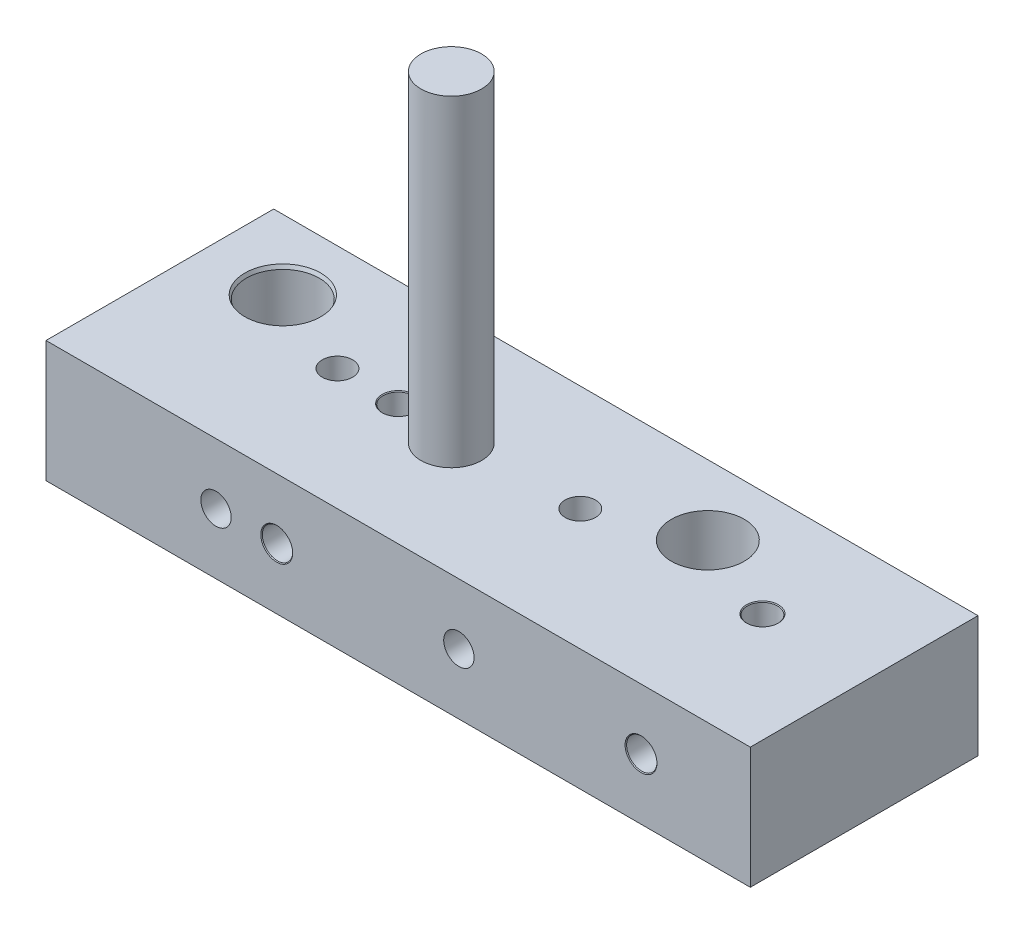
ISO-10303-21;
HEADER;
FILE_DESCRIPTION(('STEP AP214'),'2;1');
FILE_NAME('part.step','',(''),(''),'','','');
FILE_SCHEMA(('AUTOMOTIVE_DESIGN { 1 0 10303 214 1 1 1 1 }'));
ENDSEC;
DATA;
#1=APPLICATION_CONTEXT('core data for automotive mechanical design processes');
#2=APPLICATION_PROTOCOL_DEFINITION('international standard','automotive_design',2000,#1);
#3=PRODUCT_CONTEXT('',#1,'mechanical');
#4=PRODUCT('Part','Part','',(#3));
#5=PRODUCT_RELATED_PRODUCT_CATEGORY('part','',(#4));
#6=PRODUCT_DEFINITION_FORMATION('','',#4);
#7=PRODUCT_DEFINITION_CONTEXT('part definition',#1,'design');
#8=PRODUCT_DEFINITION('design','',#6,#7);
#9=PRODUCT_DEFINITION_SHAPE('','',#8);
#10=(LENGTH_UNIT() NAMED_UNIT(*) SI_UNIT(.MILLI.,.METRE.));
#11=(NAMED_UNIT(*) PLANE_ANGLE_UNIT() SI_UNIT($,.RADIAN.));
#12=(NAMED_UNIT(*) SI_UNIT($,.STERADIAN.) SOLID_ANGLE_UNIT());
#13=UNCERTAINTY_MEASURE_WITH_UNIT(LENGTH_MEASURE(1.E-05),#10,'distance_accuracy_value','');
#14=(GEOMETRIC_REPRESENTATION_CONTEXT(3) GLOBAL_UNCERTAINTY_ASSIGNED_CONTEXT((#13)) GLOBAL_UNIT_ASSIGNED_CONTEXT((#10,
#11,#12)) REPRESENTATION_CONTEXT('',''));
#15=CARTESIAN_POINT('',(0.,0.,0.));
#16=DIRECTION('',(0.,0.,1.));
#17=DIRECTION('',(1.,0.,0.));
#18=AXIS2_PLACEMENT_3D('',#15,#16,#17);
#19=CARTESIAN_POINT('',(0.,20.,-37.5));
#20=DIRECTION('',(0.,-1.,0.));
#21=DIRECTION('',(0.,0.,-1.));
#22=AXIS2_PLACEMENT_3D('',#19,#20,#21);
#23=PLANE('',#22);
#24=CARTESIAN_POINT('',(83.,20.,-26.));
#25=DIRECTION('',(0.,-1.,0.));
#26=DIRECTION('',(0.,0.,-1.));
#27=AXIS2_PLACEMENT_3D('',#24,#25,#26);
#28=CIRCLE('',#27,6.);
#29=CARTESIAN_POINT('',(83.,20.,-32.));
#30=VERTEX_POINT('',#29);
#31=EDGE_CURVE('E9178',#30,#30,#28,.T.);
#32=ORIENTED_EDGE('',*,*,#31,.T.);
#33=EDGE_LOOP('',(#32));
#34=FACE_BOUND('',#33,.T.);
#35=DIRECTION('',(0.,0.,1.));
#36=VECTOR('',#35,1.);
#37=CARTESIAN_POINT('',(0.,20.,0.));
#38=LINE('',#37,#36);
#39=CARTESIAN_POINT('',(0.,20.,-37.5));
#40=VERTEX_POINT('',#39);
#41=CARTESIAN_POINT('',(0.,20.,0.));
#42=VERTEX_POINT('',#41);
#43=EDGE_CURVE('E9306',#40,#42,#38,.T.);
#44=ORIENTED_EDGE('',*,*,#43,.T.);
#45=DIRECTION('',(1.,0.,0.));
#46=VECTOR('',#45,1.);
#47=CARTESIAN_POINT('',(0.,20.,0.));
#48=LINE('',#47,#46);
#49=CARTESIAN_POINT('',(116.,20.,0.));
#50=VERTEX_POINT('',#49);
#51=EDGE_CURVE('E9304',#42,#50,#48,.T.);
#52=ORIENTED_EDGE('',*,*,#51,.T.);
#53=DIRECTION('',(0.,0.,-1.));
#54=VECTOR('',#53,1.);
#55=CARTESIAN_POINT('',(116.,20.,0.));
#56=LINE('',#55,#54);
#57=CARTESIAN_POINT('',(116.,20.,-37.5));
#58=VERTEX_POINT('',#57);
#59=EDGE_CURVE('E9302',#50,#58,#56,.T.);
#60=ORIENTED_EDGE('',*,*,#59,.T.);
#61=DIRECTION('',(-1.,0.,0.));
#62=VECTOR('',#61,1.);
#63=CARTESIAN_POINT('',(0.,20.,-37.5));
#64=LINE('',#63,#62);
#65=EDGE_CURVE('E9300',#58,#40,#64,.T.);
#66=ORIENTED_EDGE('',*,*,#65,.T.);
#67=EDGE_LOOP('',(#44,#52,#60,#66));
#68=FACE_BOUND('',#67,.T.);
#69=CARTESIAN_POINT('',(13.,20.,-26.));
#70=DIRECTION('',(0.,-1.,0.));
#71=DIRECTION('',(0.,0.,-1.));
#72=AXIS2_PLACEMENT_3D('',#69,#70,#71);
#73=CIRCLE('',#72,6.25);
#74=CARTESIAN_POINT('',(13.,20.,-32.25));
#75=VERTEX_POINT('',#74);
#76=EDGE_CURVE('E9327',#75,#75,#73,.T.);
#77=ORIENTED_EDGE('',*,*,#76,.T.);
#78=EDGE_LOOP('',(#77));
#79=FACE_BOUND('',#78,.T.);
#80=CARTESIAN_POINT('',(28.,20.,-20.));
#81=DIRECTION('',(0.,-1.,0.));
#82=DIRECTION('',(0.,0.,-1.));
#83=AXIS2_PLACEMENT_3D('',#80,#81,#82);
#84=CIRCLE('',#83,2.5);
#85=CARTESIAN_POINT('',(28.,20.,-22.5));
#86=VERTEX_POINT('',#85);
#87=EDGE_CURVE('E9333',#86,#86,#84,.T.);
#88=ORIENTED_EDGE('',*,*,#87,.T.);
#89=EDGE_LOOP('',(#88));
#90=FACE_BOUND('',#89,.T.);
#91=CARTESIAN_POINT('',(68.,20.,-20.));
#92=DIRECTION('',(0.,-1.,0.));
#93=DIRECTION('',(0.,0.,-1.));
#94=AXIS2_PLACEMENT_3D('',#91,#92,#93);
#95=CIRCLE('',#94,2.5);
#96=CARTESIAN_POINT('',(68.,20.,-22.5));
#97=VERTEX_POINT('',#96);
#98=EDGE_CURVE('E9339',#97,#97,#95,.T.);
#99=ORIENTED_EDGE('',*,*,#98,.T.);
#100=EDGE_LOOP('',(#99));
#101=FACE_BOUND('',#100,.T.);
#102=CARTESIAN_POINT('',(38.,20.,-20.));
#103=DIRECTION('',(0.,-1.,0.));
#104=DIRECTION('',(0.,0.,-1.));
#105=AXIS2_PLACEMENT_3D('',#102,#103,#104);
#106=CIRCLE('',#105,2.625);
#107=CARTESIAN_POINT('',(38.,20.,-22.625));
#108=VERTEX_POINT('',#107);
#109=EDGE_CURVE('E9351',#108,#108,#106,.T.);
#110=ORIENTED_EDGE('',*,*,#109,.T.);
#111=EDGE_LOOP('',(#110));
#112=FACE_BOUND('',#111,.T.);
#113=CARTESIAN_POINT('',(98.,20.,-20.));
#114=DIRECTION('',(0.,-1.,0.));
#115=DIRECTION('',(0.,0.,-1.));
#116=AXIS2_PLACEMENT_3D('',#113,#114,#115);
#117=CIRCLE('',#116,2.62499999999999);
#118=CARTESIAN_POINT('',(98.,20.,-22.625));
#119=VERTEX_POINT('',#118);
#120=EDGE_CURVE('E9363',#119,#119,#117,.T.);
#121=ORIENTED_EDGE('',*,*,#120,.T.);
#122=EDGE_LOOP('',(#121));
#123=FACE_BOUND('',#122,.T.);
#124=CARTESIAN_POINT('',(48.,20.,-18.75));
#125=DIRECTION('',(0.,-1.,0.));
#126=DIRECTION('',(0.,0.,-1.));
#127=AXIS2_PLACEMENT_3D('',#124,#125,#126);
#128=CIRCLE('',#127,5.);
#129=CARTESIAN_POINT('',(48.,20.,-23.75));
#130=VERTEX_POINT('',#129);
#131=EDGE_CURVE('E11',#130,#130,#128,.F.);
#132=ORIENTED_EDGE('',*,*,#131,.F.);
#133=EDGE_LOOP('',(#132));
#134=FACE_BOUND('',#133,.T.);
#135=ADVANCED_FACE('F9174',(#34,#68,#79,#90,#101,#112,#123,#134),#23,.F.);
#136=CARTESIAN_POINT('',(68.,0.,-20.));
#137=DIRECTION('',(0.,-1.,0.));
#138=DIRECTION('',(0.,0.,-1.));
#139=AXIS2_PLACEMENT_3D('',#136,#137,#138);
#140=CYLINDRICAL_SURFACE('',#139,2.5);
#141=CARTESIAN_POINT('',(68.,0.,-20.));
#142=DIRECTION('',(0.,-1.,0.));
#143=DIRECTION('',(0.,0.,-1.));
#144=AXIS2_PLACEMENT_3D('',#141,#142,#143);
#145=CIRCLE('',#144,2.49999999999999);
#146=CARTESIAN_POINT('',(68.,0.,-22.5));
#147=VERTEX_POINT('',#146);
#148=EDGE_CURVE('E9336',#147,#147,#145,.T.);
#149=ORIENTED_EDGE('',*,*,#148,.T.);
#150=EDGE_LOOP('',(#149));
#151=FACE_BOUND('',#150,.T.);
#152=CARTESIAN_POINT('',(68.,10.,-20.));
#153=DIRECTION('',(0.,-0.707106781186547,-0.707106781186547));
#154=DIRECTION('',(0.,-0.707106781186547,0.707106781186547));
#155=AXIS2_PLACEMENT_3D('',#152,#153,#154);
#156=ELLIPSE('',#155,3.53553390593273,2.49999999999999);
#157=CARTESIAN_POINT('',(65.5,10.,-20.));
#158=VERTEX_POINT('',#157);
#159=CARTESIAN_POINT('',(70.5,10.,-20.));
#160=VERTEX_POINT('',#159);
#161=EDGE_CURVE('E9189',#158,#160,#156,.F.);
#162=ORIENTED_EDGE('',*,*,#161,.T.);
#163=CARTESIAN_POINT('',(68.,10.,-20.));
#164=DIRECTION('',(0.,-0.707106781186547,0.707106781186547));
#165=DIRECTION('',(0.,-0.707106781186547,-0.707106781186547));
#166=AXIS2_PLACEMENT_3D('',#163,#164,#165);
#167=ELLIPSE('',#166,3.53553390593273,2.49999999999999);
#168=EDGE_CURVE('E9183',#160,#158,#167,.F.);
#169=ORIENTED_EDGE('',*,*,#168,.T.);
#170=EDGE_LOOP('',(#162,#169));
#171=FACE_BOUND('',#170,.T.);
#172=ADVANCED_FACE('F9252',(#151,#171),#140,.F.);
#173=CARTESIAN_POINT('',(28.,0.,-20.));
#174=DIRECTION('',(0.,-1.,0.));
#175=DIRECTION('',(0.,0.,-1.));
#176=AXIS2_PLACEMENT_3D('',#173,#174,#175);
#177=CYLINDRICAL_SURFACE('',#176,2.49999999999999);
#178=CARTESIAN_POINT('',(28.,0.,-20.));
#179=DIRECTION('',(0.,-1.,0.));
#180=DIRECTION('',(0.,0.,-1.));
#181=AXIS2_PLACEMENT_3D('',#178,#179,#180);
#182=CIRCLE('',#181,2.49999999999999);
#183=CARTESIAN_POINT('',(28.,0.,-22.5));
#184=VERTEX_POINT('',#183);
#185=EDGE_CURVE('E9330',#184,#184,#182,.T.);
#186=ORIENTED_EDGE('',*,*,#185,.T.);
#187=EDGE_LOOP('',(#186));
#188=FACE_BOUND('',#187,.T.);
#189=CARTESIAN_POINT('',(28.,10.,-20.));
#190=DIRECTION('',(0.,-0.707106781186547,-0.707106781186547));
#191=DIRECTION('',(0.,-0.707106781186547,0.707106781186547));
#192=AXIS2_PLACEMENT_3D('',#189,#190,#191);
#193=ELLIPSE('',#192,3.53553390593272,2.49999999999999);
#194=CARTESIAN_POINT('',(25.5,10.,-20.));
#195=VERTEX_POINT('',#194);
#196=CARTESIAN_POINT('',(30.5,10.,-20.));
#197=VERTEX_POINT('',#196);
#198=EDGE_CURVE('E9196',#195,#197,#193,.F.);
#199=ORIENTED_EDGE('',*,*,#198,.T.);
#200=CARTESIAN_POINT('',(28.,10.,-20.));
#201=DIRECTION('',(0.,-0.707106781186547,0.707106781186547));
#202=DIRECTION('',(0.,-0.707106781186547,-0.707106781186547));
#203=AXIS2_PLACEMENT_3D('',#200,#201,#202);
#204=ELLIPSE('',#203,3.53553390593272,2.49999999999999);
#205=EDGE_CURVE('E9250',#197,#195,#204,.F.);
#206=ORIENTED_EDGE('',*,*,#205,.T.);
#207=EDGE_LOOP('',(#199,#206));
#208=FACE_BOUND('',#207,.T.);
#209=ADVANCED_FACE('F9549',(#188,#208),#177,.F.);
#210=CARTESIAN_POINT('',(98.,0.,-20.));
#211=DIRECTION('',(0.,-1.,0.));
#212=DIRECTION('',(0.,0.,-1.));
#213=AXIS2_PLACEMENT_3D('',#210,#211,#212);
#214=CYLINDRICAL_SURFACE('',#213,2.5);
#215=CARTESIAN_POINT('',(98.,0.125000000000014,-20.));
#216=DIRECTION('',(0.,-1.,0.));
#217=DIRECTION('',(0.,0.,-1.));
#218=AXIS2_PLACEMENT_3D('',#215,#216,#217);
#219=CIRCLE('',#218,2.49999999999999);
#220=CARTESIAN_POINT('',(98.,0.125000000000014,-22.5));
#221=VERTEX_POINT('',#220);
#222=EDGE_CURVE('E9357',#221,#221,#219,.T.);
#223=ORIENTED_EDGE('',*,*,#222,.T.);
#224=EDGE_LOOP('',(#223));
#225=FACE_BOUND('',#224,.T.);
#226=CARTESIAN_POINT('',(98.,10.,-20.));
#227=DIRECTION('',(0.,-0.707106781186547,-0.707106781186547));
#228=DIRECTION('',(0.,-0.707106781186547,0.707106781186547));
#229=AXIS2_PLACEMENT_3D('',#226,#227,#228);
#230=ELLIPSE('',#229,3.53553390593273,2.5);
#231=CARTESIAN_POINT('',(95.5,10.,-20.));
#232=VERTEX_POINT('',#231);
#233=CARTESIAN_POINT('',(100.5,10.,-20.));
#234=VERTEX_POINT('',#233);
#235=EDGE_CURVE('E9275',#232,#234,#230,.F.);
#236=ORIENTED_EDGE('',*,*,#235,.T.);
#237=CARTESIAN_POINT('',(98.,10.,-20.));
#238=DIRECTION('',(0.,-0.707106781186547,0.707106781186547));
#239=DIRECTION('',(0.,-0.707106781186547,-0.707106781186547));
#240=AXIS2_PLACEMENT_3D('',#237,#238,#239);
#241=ELLIPSE('',#240,3.53553390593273,2.5);
#242=EDGE_CURVE('E9266',#234,#232,#241,.F.);
#243=ORIENTED_EDGE('',*,*,#242,.T.);
#244=EDGE_LOOP('',(#236,#243));
#245=FACE_BOUND('',#244,.T.);
#246=ADVANCED_FACE('F9525',(#225,#245),#214,.F.);
#247=CARTESIAN_POINT('',(38.,0.,-20.));
#248=DIRECTION('',(0.,-1.,0.));
#249=DIRECTION('',(0.,0.,-1.));
#250=AXIS2_PLACEMENT_3D('',#247,#248,#249);
#251=CYLINDRICAL_SURFACE('',#250,2.5);
#252=CARTESIAN_POINT('',(38.,0.125,-20.));
#253=DIRECTION('',(0.,-1.,0.));
#254=DIRECTION('',(0.,0.,-1.));
#255=AXIS2_PLACEMENT_3D('',#252,#253,#254);
#256=CIRCLE('',#255,2.5);
#257=CARTESIAN_POINT('',(38.,0.125,-22.5));
#258=VERTEX_POINT('',#257);
#259=EDGE_CURVE('E9345',#258,#258,#256,.T.);
#260=ORIENTED_EDGE('',*,*,#259,.T.);
#261=EDGE_LOOP('',(#260));
#262=FACE_BOUND('',#261,.T.);
#263=CARTESIAN_POINT('',(38.,10.,-20.));
#264=DIRECTION('',(0.,-0.707106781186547,-0.707106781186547));
#265=DIRECTION('',(0.,-0.707106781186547,0.707106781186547));
#266=AXIS2_PLACEMENT_3D('',#263,#264,#265);
#267=ELLIPSE('',#266,3.53553390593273,2.49999999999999);
#268=CARTESIAN_POINT('',(35.5,10.,-20.));
#269=VERTEX_POINT('',#268);
#270=CARTESIAN_POINT('',(40.5,10.,-20.));
#271=VERTEX_POINT('',#270);
#272=EDGE_CURVE('E9286',#269,#271,#267,.F.);
#273=ORIENTED_EDGE('',*,*,#272,.T.);
#274=CARTESIAN_POINT('',(38.,10.,-20.));
#275=DIRECTION('',(0.,-0.707106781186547,0.707106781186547));
#276=DIRECTION('',(0.,-0.707106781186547,-0.707106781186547));
#277=AXIS2_PLACEMENT_3D('',#274,#275,#276);
#278=ELLIPSE('',#277,3.53553390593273,2.49999999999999);
#279=EDGE_CURVE('E9277',#271,#269,#278,.F.);
#280=ORIENTED_EDGE('',*,*,#279,.T.);
#281=EDGE_LOOP('',(#273,#280));
#282=FACE_BOUND('',#281,.T.);
#283=ADVANCED_FACE('F9538',(#262,#282),#251,.F.);
#284=CARTESIAN_POINT('',(0.,20.,0.));
#285=DIRECTION('',(1.,0.,0.));
#286=DIRECTION('',(0.,0.,-1.));
#287=AXIS2_PLACEMENT_3D('',#284,#285,#286);
#288=PLANE('',#287);
#289=DIRECTION('',(0.,0.,1.));
#290=VECTOR('',#289,1.);
#291=CARTESIAN_POINT('',(0.,0.,0.));
#292=LINE('',#291,#290);
#293=CARTESIAN_POINT('',(0.,0.,-37.5));
#294=VERTEX_POINT('',#293);
#295=CARTESIAN_POINT('',(0.,0.,0.));
#296=VERTEX_POINT('',#295);
#297=EDGE_CURVE('E9315',#294,#296,#292,.T.);
#298=ORIENTED_EDGE('',*,*,#297,.T.);
#299=DIRECTION('',(0.,-1.,0.));
#300=VECTOR('',#299,1.);
#301=CARTESIAN_POINT('',(0.,20.,0.));
#302=LINE('',#301,#300);
#303=EDGE_CURVE('E9288',#42,#296,#302,.T.);
#304=ORIENTED_EDGE('',*,*,#303,.F.);
#305=ORIENTED_EDGE('',*,*,#43,.F.);
#306=DIRECTION('',(0.,-1.,0.));
#307=VECTOR('',#306,1.);
#308=CARTESIAN_POINT('',(0.,20.,-37.5));
#309=LINE('',#308,#307);
#310=EDGE_CURVE('E9297',#40,#294,#309,.T.);
#311=ORIENTED_EDGE('',*,*,#310,.T.);
#312=EDGE_LOOP('',(#298,#304,#305,#311));
#313=FACE_BOUND('',#312,.T.);
#314=ADVANCED_FACE('F9176',(#313),#288,.F.);
#315=CARTESIAN_POINT('',(0.,20.,0.));
#316=DIRECTION('',(0.,0.,-1.));
#317=DIRECTION('',(-1.,0.,0.));
#318=AXIS2_PLACEMENT_3D('',#315,#316,#317);
#319=PLANE('',#318);
#320=CARTESIAN_POINT('',(68.,10.,0.));
#321=DIRECTION('',(0.,0.,1.));
#322=DIRECTION('',(1.,0.,0.));
#323=AXIS2_PLACEMENT_3D('',#320,#321,#322);
#324=CIRCLE('',#323,2.49999999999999);
#325=CARTESIAN_POINT('',(70.5,10.,0.));
#326=VERTEX_POINT('',#325);
#327=EDGE_CURVE('E9396',#326,#326,#324,.T.);
#328=ORIENTED_EDGE('',*,*,#327,.F.);
#329=EDGE_LOOP('',(#328));
#330=FACE_BOUND('',#329,.T.);
#331=CARTESIAN_POINT('',(28.,10.,0.));
#332=DIRECTION('',(0.,0.,1.));
#333=DIRECTION('',(1.,0.,0.));
#334=AXIS2_PLACEMENT_3D('',#331,#332,#333);
#335=CIRCLE('',#334,2.49999999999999);
#336=CARTESIAN_POINT('',(30.5,10.,0.));
#337=VERTEX_POINT('',#336);
#338=EDGE_CURVE('E9390',#337,#337,#335,.T.);
#339=ORIENTED_EDGE('',*,*,#338,.F.);
#340=EDGE_LOOP('',(#339));
#341=FACE_BOUND('',#340,.T.);
#342=CARTESIAN_POINT('',(98.,10.,0.));
#343=DIRECTION('',(0.,0.,1.));
#344=DIRECTION('',(1.,0.,0.));
#345=AXIS2_PLACEMENT_3D('',#342,#343,#344);
#346=CIRCLE('',#345,2.625);
#347=CARTESIAN_POINT('',(100.625,10.,0.));
#348=VERTEX_POINT('',#347);
#349=EDGE_CURVE('E9378',#348,#348,#346,.T.);
#350=ORIENTED_EDGE('',*,*,#349,.F.);
#351=EDGE_LOOP('',(#350));
#352=FACE_BOUND('',#351,.T.);
#353=CARTESIAN_POINT('',(38.,10.,0.));
#354=DIRECTION('',(0.,0.,1.));
#355=DIRECTION('',(1.,0.,0.));
#356=AXIS2_PLACEMENT_3D('',#353,#354,#355);
#357=CIRCLE('',#356,2.625);
#358=CARTESIAN_POINT('',(40.625,10.,0.));
#359=VERTEX_POINT('',#358);
#360=EDGE_CURVE('E9366',#359,#359,#357,.T.);
#361=ORIENTED_EDGE('',*,*,#360,.F.);
#362=EDGE_LOOP('',(#361));
#363=FACE_BOUND('',#362,.T.);
#364=DIRECTION('',(1.,0.,0.));
#365=VECTOR('',#364,1.);
#366=CARTESIAN_POINT('',(0.,0.,0.));
#367=LINE('',#366,#365);
#368=CARTESIAN_POINT('',(116.,0.,0.));
#369=VERTEX_POINT('',#368);
#370=EDGE_CURVE('E9313',#296,#369,#367,.T.);
#371=ORIENTED_EDGE('',*,*,#370,.T.);
#372=DIRECTION('',(0.,-1.,0.));
#373=VECTOR('',#372,1.);
#374=CARTESIAN_POINT('',(116.,20.,0.));
#375=LINE('',#374,#373);
#376=EDGE_CURVE('E9291',#50,#369,#375,.T.);
#377=ORIENTED_EDGE('',*,*,#376,.F.);
#378=ORIENTED_EDGE('',*,*,#51,.F.);
#379=ORIENTED_EDGE('',*,*,#303,.T.);
#380=EDGE_LOOP('',(#371,#377,#378,#379));
#381=FACE_BOUND('',#380,.T.);
#382=ADVANCED_FACE('F9452',(#330,#341,#352,#363,#381),#319,.F.);
#383=CARTESIAN_POINT('',(116.,20.,0.));
#384=DIRECTION('',(-1.,0.,0.));
#385=DIRECTION('',(0.,0.,1.));
#386=AXIS2_PLACEMENT_3D('',#383,#384,#385);
#387=PLANE('',#386);
#388=DIRECTION('',(0.,0.,-1.));
#389=VECTOR('',#388,1.);
#390=CARTESIAN_POINT('',(116.,0.,0.));
#391=LINE('',#390,#389);
#392=CARTESIAN_POINT('',(116.,0.,-37.5));
#393=VERTEX_POINT('',#392);
#394=EDGE_CURVE('E9311',#369,#393,#391,.T.);
#395=ORIENTED_EDGE('',*,*,#394,.T.);
#396=DIRECTION('',(0.,-1.,0.));
#397=VECTOR('',#396,1.);
#398=CARTESIAN_POINT('',(116.,20.,-37.5));
#399=LINE('',#398,#397);
#400=EDGE_CURVE('E9294',#58,#393,#399,.T.);
#401=ORIENTED_EDGE('',*,*,#400,.F.);
#402=ORIENTED_EDGE('',*,*,#59,.F.);
#403=ORIENTED_EDGE('',*,*,#376,.T.);
#404=EDGE_LOOP('',(#395,#401,#402,#403));
#405=FACE_BOUND('',#404,.T.);
#406=ADVANCED_FACE('F9449',(#405),#387,.F.);
#407=CARTESIAN_POINT('',(0.,20.,-37.5));
#408=DIRECTION('',(0.,0.,1.));
#409=DIRECTION('',(1.,0.,0.));
#410=AXIS2_PLACEMENT_3D('',#407,#408,#409);
#411=PLANE('',#410);
#412=CARTESIAN_POINT('',(68.,10.,-37.5));
#413=DIRECTION('',(0.,0.,1.));
#414=DIRECTION('',(1.,0.,0.));
#415=AXIS2_PLACEMENT_3D('',#412,#413,#414);
#416=CIRCLE('',#415,2.49999999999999);
#417=CARTESIAN_POINT('',(70.5,10.,-37.5));
#418=VERTEX_POINT('',#417);
#419=EDGE_CURVE('E9399',#418,#418,#416,.T.);
#420=ORIENTED_EDGE('',*,*,#419,.T.);
#421=EDGE_LOOP('',(#420));
#422=FACE_BOUND('',#421,.T.);
#423=CARTESIAN_POINT('',(28.,10.,-37.5));
#424=DIRECTION('',(0.,0.,1.));
#425=DIRECTION('',(1.,0.,0.));
#426=AXIS2_PLACEMENT_3D('',#423,#424,#425);
#427=CIRCLE('',#426,2.49999999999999);
#428=CARTESIAN_POINT('',(30.5,10.,-37.5));
#429=VERTEX_POINT('',#428);
#430=EDGE_CURVE('E9393',#429,#429,#427,.T.);
#431=ORIENTED_EDGE('',*,*,#430,.T.);
#432=EDGE_LOOP('',(#431));
#433=FACE_BOUND('',#432,.T.);
#434=CARTESIAN_POINT('',(98.,10.,-37.5));
#435=DIRECTION('',(0.,0.,1.));
#436=DIRECTION('',(1.,0.,0.));
#437=AXIS2_PLACEMENT_3D('',#434,#435,#436);
#438=CIRCLE('',#437,2.62499999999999);
#439=CARTESIAN_POINT('',(100.625,10.,-37.5));
#440=VERTEX_POINT('',#439);
#441=EDGE_CURVE('E9387',#440,#440,#438,.T.);
#442=ORIENTED_EDGE('',*,*,#441,.T.);
#443=EDGE_LOOP('',(#442));
#444=FACE_BOUND('',#443,.T.);
#445=CARTESIAN_POINT('',(38.,10.,-37.5));
#446=DIRECTION('',(0.,0.,1.));
#447=DIRECTION('',(1.,0.,0.));
#448=AXIS2_PLACEMENT_3D('',#445,#446,#447);
#449=CIRCLE('',#448,2.62499999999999);
#450=CARTESIAN_POINT('',(40.625,10.,-37.5));
#451=VERTEX_POINT('',#450);
#452=EDGE_CURVE('E9375',#451,#451,#449,.T.);
#453=ORIENTED_EDGE('',*,*,#452,.T.);
#454=EDGE_LOOP('',(#453));
#455=FACE_BOUND('',#454,.T.);
#456=DIRECTION('',(-1.,0.,0.));
#457=VECTOR('',#456,1.);
#458=CARTESIAN_POINT('',(0.,0.,-37.5));
#459=LINE('',#458,#457);
#460=EDGE_CURVE('E9309',#393,#294,#459,.T.);
#461=ORIENTED_EDGE('',*,*,#460,.T.);
#462=ORIENTED_EDGE('',*,*,#310,.F.);
#463=ORIENTED_EDGE('',*,*,#65,.F.);
#464=ORIENTED_EDGE('',*,*,#400,.T.);
#465=EDGE_LOOP('',(#461,#462,#463,#464));
#466=FACE_BOUND('',#465,.T.);
#467=ADVANCED_FACE('F9425',(#422,#433,#444,#455,#466),#411,.F.);
#468=CARTESIAN_POINT('',(0.,0.,-37.5));
#469=DIRECTION('',(0.,-1.,0.));
#470=DIRECTION('',(0.,0.,-1.));
#471=AXIS2_PLACEMENT_3D('',#468,#469,#470);
#472=PLANE('',#471);
#473=CARTESIAN_POINT('',(83.,0.,-26.));
#474=DIRECTION('',(0.,-1.,0.));
#475=DIRECTION('',(0.,0.,-1.));
#476=AXIS2_PLACEMENT_3D('',#473,#474,#475);
#477=CIRCLE('',#476,6.25000000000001);
#478=CARTESIAN_POINT('',(83.,0.,-32.25));
#479=VERTEX_POINT('',#478);
#480=EDGE_CURVE('E9405',#479,#479,#477,.T.);
#481=ORIENTED_EDGE('',*,*,#480,.F.);
#482=EDGE_LOOP('',(#481));
#483=FACE_BOUND('',#482,.T.);
#484=CARTESIAN_POINT('',(98.,0.,-20.));
#485=DIRECTION('',(0.,-1.,0.));
#486=DIRECTION('',(0.,0.,-1.));
#487=AXIS2_PLACEMENT_3D('',#484,#485,#486);
#488=CIRCLE('',#487,2.625);
#489=CARTESIAN_POINT('',(98.,0.,-22.625));
#490=VERTEX_POINT('',#489);
#491=EDGE_CURVE('E9354',#490,#490,#488,.T.);
#492=ORIENTED_EDGE('',*,*,#491,.F.);
#493=EDGE_LOOP('',(#492));
#494=FACE_BOUND('',#493,.T.);
#495=CARTESIAN_POINT('',(38.,0.,-20.));
#496=DIRECTION('',(0.,-1.,0.));
#497=DIRECTION('',(0.,0.,-1.));
#498=AXIS2_PLACEMENT_3D('',#495,#496,#497);
#499=CIRCLE('',#498,2.625);
#500=CARTESIAN_POINT('',(38.,0.,-22.625));
#501=VERTEX_POINT('',#500);
#502=EDGE_CURVE('E9342',#501,#501,#499,.T.);
#503=ORIENTED_EDGE('',*,*,#502,.F.);
#504=EDGE_LOOP('',(#503));
#505=FACE_BOUND('',#504,.T.);
#506=ORIENTED_EDGE('',*,*,#148,.F.);
#507=EDGE_LOOP('',(#506));
#508=FACE_BOUND('',#507,.T.);
#509=ORIENTED_EDGE('',*,*,#185,.F.);
#510=EDGE_LOOP('',(#509));
#511=FACE_BOUND('',#510,.T.);
#512=CARTESIAN_POINT('',(13.,0.,-26.));
#513=DIRECTION('',(0.,-1.,0.));
#514=DIRECTION('',(0.,0.,-1.));
#515=AXIS2_PLACEMENT_3D('',#512,#513,#514);
#516=CIRCLE('',#515,6.25);
#517=CARTESIAN_POINT('',(13.,0.,-32.25));
#518=VERTEX_POINT('',#517);
#519=EDGE_CURVE('E9318',#518,#518,#516,.T.);
#520=ORIENTED_EDGE('',*,*,#519,.F.);
#521=EDGE_LOOP('',(#520));
#522=FACE_BOUND('',#521,.T.);
#523=ORIENTED_EDGE('',*,*,#297,.F.);
#524=ORIENTED_EDGE('',*,*,#460,.F.);
#525=ORIENTED_EDGE('',*,*,#394,.F.);
#526=ORIENTED_EDGE('',*,*,#370,.F.);
#527=EDGE_LOOP('',(#523,#524,#525,#526));
#528=FACE_BOUND('',#527,.T.);
#529=ADVANCED_FACE('F9421',(#483,#494,#505,#508,#511,#522,#528),#472,.T.);
#530=CARTESIAN_POINT('',(13.,0.,-26.));
#531=DIRECTION('',(0.,-1.,0.));
#532=DIRECTION('',(0.,0.,-1.));
#533=AXIS2_PLACEMENT_3D('',#530,#531,#532);
#534=CONICAL_SURFACE('',#533,6.25,0.392699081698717);
#535=CARTESIAN_POINT('',(13.,0.603553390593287,-26.));
#536=DIRECTION('',(0.,-1.,0.));
#537=DIRECTION('',(0.,0.,-1.));
#538=AXIS2_PLACEMENT_3D('',#535,#536,#537);
#539=CIRCLE('',#538,6.);
#540=CARTESIAN_POINT('',(13.,0.603553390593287,-32.));
#541=VERTEX_POINT('',#540);
#542=EDGE_CURVE('E9321',#541,#541,#539,.T.);
#543=ORIENTED_EDGE('',*,*,#542,.F.);
#544=EDGE_LOOP('',(#543));
#545=FACE_BOUND('',#544,.T.);
#546=ORIENTED_EDGE('',*,*,#519,.T.);
#547=EDGE_LOOP('',(#546));
#548=FACE_BOUND('',#547,.T.);
#549=ADVANCED_FACE('F9424',(#545,#548),#534,.F.);
#550=CARTESIAN_POINT('',(13.,0.,-26.));
#551=DIRECTION('',(0.,-1.,0.));
#552=DIRECTION('',(0.,0.,-1.));
#553=AXIS2_PLACEMENT_3D('',#550,#551,#552);
#554=CYLINDRICAL_SURFACE('',#553,6.);
#555=CARTESIAN_POINT('',(13.,19.3964466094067,-26.));
#556=DIRECTION('',(0.,-1.,0.));
#557=DIRECTION('',(0.,0.,-1.));
#558=AXIS2_PLACEMENT_3D('',#555,#556,#557);
#559=CIRCLE('',#558,5.99999999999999);
#560=CARTESIAN_POINT('',(13.,19.3964466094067,-32.));
#561=VERTEX_POINT('',#560);
#562=EDGE_CURVE('E9324',#561,#561,#559,.T.);
#563=ORIENTED_EDGE('',*,*,#562,.F.);
#564=EDGE_LOOP('',(#563));
#565=FACE_BOUND('',#564,.T.);
#566=ORIENTED_EDGE('',*,*,#542,.T.);
#567=EDGE_LOOP('',(#566));
#568=FACE_BOUND('',#567,.T.);
#569=ADVANCED_FACE('F9552',(#565,#568),#554,.F.);
#570=CARTESIAN_POINT('',(13.,19.3964466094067,-26.));
#571=DIRECTION('',(0.,1.,0.));
#572=DIRECTION('',(0.,0.,1.));
#573=AXIS2_PLACEMENT_3D('',#570,#571,#572);
#574=CONICAL_SURFACE('',#573,5.99999999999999,0.392699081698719);
#575=ORIENTED_EDGE('',*,*,#76,.F.);
#576=EDGE_LOOP('',(#575));
#577=FACE_BOUND('',#576,.T.);
#578=ORIENTED_EDGE('',*,*,#562,.T.);
#579=EDGE_LOOP('',(#578));
#580=FACE_BOUND('',#579,.T.);
#581=ADVANCED_FACE('F9547',(#577,#580),#574,.F.);
#582=CARTESIAN_POINT('',(28.,10.,-20.));
#583=DIRECTION('',(0.,-0.707106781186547,-0.707106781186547));
#584=DIRECTION('',(0.,-0.707106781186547,0.707106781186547));
#585=AXIS2_PLACEMENT_3D('',#582,#583,#584);
#586=ELLIPSE('',#585,3.53553390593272,2.49999999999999);
#587=EDGE_CURVE('E9262',#195,#197,#586,.T.);
#588=ORIENTED_EDGE('',*,*,#587,.T.);
#589=CARTESIAN_POINT('',(28.,10.,-20.));
#590=DIRECTION('',(0.,-0.707106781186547,0.707106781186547));
#591=DIRECTION('',(0.,-0.707106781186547,-0.707106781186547));
#592=AXIS2_PLACEMENT_3D('',#589,#590,#591);
#593=ELLIPSE('',#592,3.53553390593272,2.49999999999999);
#594=EDGE_CURVE('E9259',#197,#195,#593,.T.);
#595=ORIENTED_EDGE('',*,*,#594,.T.);
#596=EDGE_LOOP('',(#588,#595));
#597=FACE_BOUND('',#596,.T.);
#598=ORIENTED_EDGE('',*,*,#87,.F.);
#599=EDGE_LOOP('',(#598));
#600=FACE_BOUND('',#599,.T.);
#601=ADVANCED_FACE('F9544',(#597,#600),#177,.F.);
#602=CARTESIAN_POINT('',(68.,10.,-20.));
#603=DIRECTION('',(0.,-0.707106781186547,-0.707106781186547));
#604=DIRECTION('',(0.,-0.707106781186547,0.707106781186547));
#605=AXIS2_PLACEMENT_3D('',#602,#603,#604);
#606=ELLIPSE('',#605,3.53553390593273,2.49999999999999);
#607=EDGE_CURVE('E9242',#158,#160,#606,.T.);
#608=ORIENTED_EDGE('',*,*,#607,.T.);
#609=CARTESIAN_POINT('',(68.,10.,-20.));
#610=DIRECTION('',(0.,-0.707106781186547,0.707106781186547));
#611=DIRECTION('',(0.,-0.707106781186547,-0.707106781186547));
#612=AXIS2_PLACEMENT_3D('',#609,#610,#611);
#613=ELLIPSE('',#612,3.53553390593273,2.49999999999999);
#614=EDGE_CURVE('E9246',#160,#158,#613,.T.);
#615=ORIENTED_EDGE('',*,*,#614,.T.);
#616=EDGE_LOOP('',(#608,#615));
#617=FACE_BOUND('',#616,.T.);
#618=ORIENTED_EDGE('',*,*,#98,.F.);
#619=EDGE_LOOP('',(#618));
#620=FACE_BOUND('',#619,.T.);
#621=ADVANCED_FACE('F9254',(#617,#620),#140,.F.);
#622=CARTESIAN_POINT('',(38.,0.,-20.));
#623=DIRECTION('',(0.,-1.,0.));
#624=DIRECTION('',(0.,0.,-1.));
#625=AXIS2_PLACEMENT_3D('',#622,#623,#624);
#626=CONICAL_SURFACE('',#625,2.625,0.785398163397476);
#627=ORIENTED_EDGE('',*,*,#259,.F.);
#628=EDGE_LOOP('',(#627));
#629=FACE_BOUND('',#628,.T.);
#630=ORIENTED_EDGE('',*,*,#502,.T.);
#631=EDGE_LOOP('',(#630));
#632=FACE_BOUND('',#631,.T.);
#633=ADVANCED_FACE('F9536',(#629,#632),#626,.F.);
#634=CARTESIAN_POINT('',(38.,10.,-20.));
#635=DIRECTION('',(0.,-0.707106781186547,-0.707106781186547));
#636=DIRECTION('',(0.,-0.707106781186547,0.707106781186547));
#637=AXIS2_PLACEMENT_3D('',#634,#635,#636);
#638=ELLIPSE('',#637,3.53553390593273,2.49999999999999);
#639=EDGE_CURVE('E9283',#269,#271,#638,.T.);
#640=ORIENTED_EDGE('',*,*,#639,.T.);
#641=CARTESIAN_POINT('',(38.,10.,-20.));
#642=DIRECTION('',(0.,-0.707106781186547,0.707106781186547));
#643=DIRECTION('',(0.,-0.707106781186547,-0.707106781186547));
#644=AXIS2_PLACEMENT_3D('',#641,#642,#643);
#645=ELLIPSE('',#644,3.53553390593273,2.49999999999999);
#646=EDGE_CURVE('E9280',#271,#269,#645,.T.);
#647=ORIENTED_EDGE('',*,*,#646,.T.);
#648=EDGE_LOOP('',(#640,#647));
#649=FACE_BOUND('',#648,.T.);
#650=CARTESIAN_POINT('',(38.,19.875,-20.));
#651=DIRECTION('',(0.,-1.,0.));
#652=DIRECTION('',(0.,0.,-1.));
#653=AXIS2_PLACEMENT_3D('',#650,#651,#652);
#654=CIRCLE('',#653,2.5);
#655=CARTESIAN_POINT('',(38.,19.875,-22.5));
#656=VERTEX_POINT('',#655);
#657=EDGE_CURVE('E9348',#656,#656,#654,.T.);
#658=ORIENTED_EDGE('',*,*,#657,.F.);
#659=EDGE_LOOP('',(#658));
#660=FACE_BOUND('',#659,.T.);
#661=ADVANCED_FACE('F9532',(#649,#660),#251,.F.);
#662=CARTESIAN_POINT('',(38.,19.875,-20.));
#663=DIRECTION('',(0.,1.,0.));
#664=DIRECTION('',(0.,0.,1.));
#665=AXIS2_PLACEMENT_3D('',#662,#663,#664);
#666=CONICAL_SURFACE('',#665,2.5,0.785398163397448);
#667=ORIENTED_EDGE('',*,*,#109,.F.);
#668=EDGE_LOOP('',(#667));
#669=FACE_BOUND('',#668,.T.);
#670=ORIENTED_EDGE('',*,*,#657,.T.);
#671=EDGE_LOOP('',(#670));
#672=FACE_BOUND('',#671,.T.);
#673=ADVANCED_FACE('F9528',(#669,#672),#666,.F.);
#674=CARTESIAN_POINT('',(98.,0.,-20.));
#675=DIRECTION('',(0.,-1.,0.));
#676=DIRECTION('',(0.,0.,-1.));
#677=AXIS2_PLACEMENT_3D('',#674,#675,#676);
#678=CONICAL_SURFACE('',#677,2.625,0.785398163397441);
#679=ORIENTED_EDGE('',*,*,#222,.F.);
#680=EDGE_LOOP('',(#679));
#681=FACE_BOUND('',#680,.T.);
#682=ORIENTED_EDGE('',*,*,#491,.T.);
#683=EDGE_LOOP('',(#682));
#684=FACE_BOUND('',#683,.T.);
#685=ADVANCED_FACE('F9523',(#681,#684),#678,.F.);
#686=CARTESIAN_POINT('',(98.,10.,-20.));
#687=DIRECTION('',(0.,-0.707106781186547,-0.707106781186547));
#688=DIRECTION('',(0.,-0.707106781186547,0.707106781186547));
#689=AXIS2_PLACEMENT_3D('',#686,#687,#688);
#690=ELLIPSE('',#689,3.53553390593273,2.5);
#691=EDGE_CURVE('E9272',#232,#234,#690,.T.);
#692=ORIENTED_EDGE('',*,*,#691,.T.);
#693=CARTESIAN_POINT('',(98.,10.,-20.));
#694=DIRECTION('',(0.,-0.707106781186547,0.707106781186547));
#695=DIRECTION('',(0.,-0.707106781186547,-0.707106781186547));
#696=AXIS2_PLACEMENT_3D('',#693,#694,#695);
#697=ELLIPSE('',#696,3.53553390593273,2.5);
#698=EDGE_CURVE('E9269',#234,#232,#697,.T.);
#699=ORIENTED_EDGE('',*,*,#698,.T.);
#700=EDGE_LOOP('',(#692,#699));
#701=FACE_BOUND('',#700,.T.);
#702=CARTESIAN_POINT('',(98.,19.875,-20.));
#703=DIRECTION('',(0.,-1.,0.));
#704=DIRECTION('',(0.,0.,-1.));
#705=AXIS2_PLACEMENT_3D('',#702,#703,#704);
#706=CIRCLE('',#705,2.5);
#707=CARTESIAN_POINT('',(98.,19.875,-22.5));
#708=VERTEX_POINT('',#707);
#709=EDGE_CURVE('E9360',#708,#708,#706,.T.);
#710=ORIENTED_EDGE('',*,*,#709,.F.);
#711=EDGE_LOOP('',(#710));
#712=FACE_BOUND('',#711,.T.);
#713=ADVANCED_FACE('F9519',(#701,#712),#214,.F.);
#714=CARTESIAN_POINT('',(98.,19.875,-20.));
#715=DIRECTION('',(0.,1.,0.));
#716=DIRECTION('',(0.,0.,1.));
#717=AXIS2_PLACEMENT_3D('',#714,#715,#716);
#718=CONICAL_SURFACE('',#717,2.5,0.785398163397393);
#719=ORIENTED_EDGE('',*,*,#120,.F.);
#720=EDGE_LOOP('',(#719));
#721=FACE_BOUND('',#720,.T.);
#722=ORIENTED_EDGE('',*,*,#709,.T.);
#723=EDGE_LOOP('',(#722));
#724=FACE_BOUND('',#723,.T.);
#725=ADVANCED_FACE('F9516',(#721,#724),#718,.F.);
#726=CARTESIAN_POINT('',(38.,10.,0.));
#727=DIRECTION('',(0.,0.,1.));
#728=DIRECTION('',(1.,0.,0.));
#729=AXIS2_PLACEMENT_3D('',#726,#727,#728);
#730=CYLINDRICAL_SURFACE('',#729,2.49999999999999);
#731=CARTESIAN_POINT('',(38.,10.,-0.125000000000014));
#732=DIRECTION('',(0.,0.,1.));
#733=DIRECTION('',(1.,0.,0.));
#734=AXIS2_PLACEMENT_3D('',#731,#732,#733);
#735=CIRCLE('',#734,2.49999999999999);
#736=CARTESIAN_POINT('',(40.5,10.,-0.125000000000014));
#737=VERTEX_POINT('',#736);
#738=EDGE_CURVE('E9369',#737,#737,#735,.T.);
#739=ORIENTED_EDGE('',*,*,#738,.T.);
#740=EDGE_LOOP('',(#739));
#741=FACE_BOUND('',#740,.T.);
#742=ORIENTED_EDGE('',*,*,#272,.F.);
#743=ORIENTED_EDGE('',*,*,#646,.F.);
#744=EDGE_LOOP('',(#742,#743));
#745=FACE_BOUND('',#744,.T.);
#746=ADVANCED_FACE('F9512',(#741,#745),#730,.F.);
#747=CARTESIAN_POINT('',(38.,10.,0.));
#748=DIRECTION('',(0.,0.,1.));
#749=DIRECTION('',(1.,0.,0.));
#750=AXIS2_PLACEMENT_3D('',#747,#748,#749);
#751=CONICAL_SURFACE('',#750,2.625,0.785398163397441);
#752=ORIENTED_EDGE('',*,*,#738,.F.);
#753=EDGE_LOOP('',(#752));
#754=FACE_BOUND('',#753,.T.);
#755=ORIENTED_EDGE('',*,*,#360,.T.);
#756=EDGE_LOOP('',(#755));
#757=FACE_BOUND('',#756,.T.);
#758=ADVANCED_FACE('F9510',(#754,#757),#751,.F.);
#759=CARTESIAN_POINT('',(38.,10.,-37.375));
#760=DIRECTION('',(0.,0.,1.));
#761=DIRECTION('',(1.,0.,0.));
#762=AXIS2_PLACEMENT_3D('',#759,#760,#761);
#763=CIRCLE('',#762,2.5);
#764=CARTESIAN_POINT('',(40.5,10.,-37.375));
#765=VERTEX_POINT('',#764);
#766=EDGE_CURVE('E9372',#765,#765,#763,.T.);
#767=ORIENTED_EDGE('',*,*,#766,.F.);
#768=EDGE_LOOP('',(#767));
#769=FACE_BOUND('',#768,.T.);
#770=ORIENTED_EDGE('',*,*,#639,.F.);
#771=ORIENTED_EDGE('',*,*,#279,.F.);
#772=EDGE_LOOP('',(#770,#771));
#773=FACE_BOUND('',#772,.T.);
#774=ADVANCED_FACE('F9506',(#769,#773),#730,.F.);
#775=CARTESIAN_POINT('',(38.,10.,-37.375));
#776=DIRECTION('',(0.,0.,-1.));
#777=DIRECTION('',(-1.,0.,0.));
#778=AXIS2_PLACEMENT_3D('',#775,#776,#777);
#779=CONICAL_SURFACE('',#778,2.5,0.785398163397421);
#780=ORIENTED_EDGE('',*,*,#452,.F.);
#781=EDGE_LOOP('',(#780));
#782=FACE_BOUND('',#781,.T.);
#783=ORIENTED_EDGE('',*,*,#766,.T.);
#784=EDGE_LOOP('',(#783));
#785=FACE_BOUND('',#784,.T.);
#786=ADVANCED_FACE('F9503',(#782,#785),#779,.F.);
#787=CARTESIAN_POINT('',(98.,10.,0.));
#788=DIRECTION('',(0.,0.,1.));
#789=DIRECTION('',(1.,0.,0.));
#790=AXIS2_PLACEMENT_3D('',#787,#788,#789);
#791=CYLINDRICAL_SURFACE('',#790,2.5);
#792=CARTESIAN_POINT('',(98.,10.,-0.125000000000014));
#793=DIRECTION('',(0.,0.,1.));
#794=DIRECTION('',(1.,0.,0.));
#795=AXIS2_PLACEMENT_3D('',#792,#793,#794);
#796=CIRCLE('',#795,2.49999999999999);
#797=CARTESIAN_POINT('',(100.5,10.,-0.125000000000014));
#798=VERTEX_POINT('',#797);
#799=EDGE_CURVE('E9381',#798,#798,#796,.T.);
#800=ORIENTED_EDGE('',*,*,#799,.T.);
#801=EDGE_LOOP('',(#800));
#802=FACE_BOUND('',#801,.T.);
#803=ORIENTED_EDGE('',*,*,#235,.F.);
#804=ORIENTED_EDGE('',*,*,#698,.F.);
#805=EDGE_LOOP('',(#803,#804));
#806=FACE_BOUND('',#805,.T.);
#807=ADVANCED_FACE('F9499',(#802,#806),#791,.F.);
#808=CARTESIAN_POINT('',(98.,10.,0.));
#809=DIRECTION('',(0.,0.,1.));
#810=DIRECTION('',(1.,0.,0.));
#811=AXIS2_PLACEMENT_3D('',#808,#809,#810);
#812=CONICAL_SURFACE('',#811,2.625,0.785398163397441);
#813=ORIENTED_EDGE('',*,*,#799,.F.);
#814=EDGE_LOOP('',(#813));
#815=FACE_BOUND('',#814,.T.);
#816=ORIENTED_EDGE('',*,*,#349,.T.);
#817=EDGE_LOOP('',(#816));
#818=FACE_BOUND('',#817,.T.);
#819=ADVANCED_FACE('F9497',(#815,#818),#812,.F.);
#820=CARTESIAN_POINT('',(98.,10.,-37.375));
#821=DIRECTION('',(0.,0.,1.));
#822=DIRECTION('',(1.,0.,0.));
#823=AXIS2_PLACEMENT_3D('',#820,#821,#822);
#824=CIRCLE('',#823,2.5);
#825=CARTESIAN_POINT('',(100.5,10.,-37.375));
#826=VERTEX_POINT('',#825);
#827=EDGE_CURVE('E9384',#826,#826,#824,.T.);
#828=ORIENTED_EDGE('',*,*,#827,.F.);
#829=EDGE_LOOP('',(#828));
#830=FACE_BOUND('',#829,.T.);
#831=ORIENTED_EDGE('',*,*,#691,.F.);
#832=ORIENTED_EDGE('',*,*,#242,.F.);
#833=EDGE_LOOP('',(#831,#832));
#834=FACE_BOUND('',#833,.T.);
#835=ADVANCED_FACE('F9493',(#830,#834),#791,.F.);
#836=CARTESIAN_POINT('',(98.,10.,-37.375));
#837=DIRECTION('',(0.,0.,-1.));
#838=DIRECTION('',(-1.,0.,0.));
#839=AXIS2_PLACEMENT_3D('',#836,#837,#838);
#840=CONICAL_SURFACE('',#839,2.5,0.785398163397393);
#841=ORIENTED_EDGE('',*,*,#441,.F.);
#842=EDGE_LOOP('',(#841));
#843=FACE_BOUND('',#842,.T.);
#844=ORIENTED_EDGE('',*,*,#827,.T.);
#845=EDGE_LOOP('',(#844));
#846=FACE_BOUND('',#845,.T.);
#847=ADVANCED_FACE('F9490',(#843,#846),#840,.F.);
#848=CARTESIAN_POINT('',(28.,10.,0.));
#849=DIRECTION('',(0.,0.,1.));
#850=DIRECTION('',(1.,0.,0.));
#851=AXIS2_PLACEMENT_3D('',#848,#849,#850);
#852=CYLINDRICAL_SURFACE('',#851,2.49999999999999);
#853=ORIENTED_EDGE('',*,*,#338,.T.);
#854=EDGE_LOOP('',(#853));
#855=FACE_BOUND('',#854,.T.);
#856=ORIENTED_EDGE('',*,*,#198,.F.);
#857=ORIENTED_EDGE('',*,*,#594,.F.);
#858=EDGE_LOOP('',(#856,#857));
#859=FACE_BOUND('',#858,.T.);
#860=ADVANCED_FACE('F9488',(#855,#859),#852,.F.);
#861=ORIENTED_EDGE('',*,*,#430,.F.);
#862=EDGE_LOOP('',(#861));
#863=FACE_BOUND('',#862,.T.);
#864=ORIENTED_EDGE('',*,*,#587,.F.);
#865=ORIENTED_EDGE('',*,*,#205,.F.);
#866=EDGE_LOOP('',(#864,#865));
#867=FACE_BOUND('',#866,.T.);
#868=ADVANCED_FACE('F9485',(#863,#867),#852,.F.);
#869=CARTESIAN_POINT('',(68.,10.,0.));
#870=DIRECTION('',(0.,0.,1.));
#871=DIRECTION('',(1.,0.,0.));
#872=AXIS2_PLACEMENT_3D('',#869,#870,#871);
#873=CYLINDRICAL_SURFACE('',#872,2.49999999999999);
#874=ORIENTED_EDGE('',*,*,#327,.T.);
#875=EDGE_LOOP('',(#874));
#876=FACE_BOUND('',#875,.T.);
#877=ORIENTED_EDGE('',*,*,#161,.F.);
#878=ORIENTED_EDGE('',*,*,#614,.F.);
#879=EDGE_LOOP('',(#877,#878));
#880=FACE_BOUND('',#879,.T.);
#881=ADVANCED_FACE('F9249',(#876,#880),#873,.F.);
#882=ORIENTED_EDGE('',*,*,#419,.F.);
#883=EDGE_LOOP('',(#882));
#884=FACE_BOUND('',#883,.T.);
#885=ORIENTED_EDGE('',*,*,#607,.F.);
#886=ORIENTED_EDGE('',*,*,#168,.F.);
#887=EDGE_LOOP('',(#885,#886));
#888=FACE_BOUND('',#887,.T.);
#889=ADVANCED_FACE('F9243',(#884,#888),#873,.F.);
#890=CARTESIAN_POINT('',(48.,73.,-18.75));
#891=DIRECTION('',(0.,-1.,0.));
#892=DIRECTION('',(0.,0.,-1.));
#893=AXIS2_PLACEMENT_3D('',#890,#891,#892);
#894=CYLINDRICAL_SURFACE('',#893,5.);
#895=CARTESIAN_POINT('',(48.,73.,-18.75));
#896=DIRECTION('',(0.,1.,0.));
#897=DIRECTION('',(0.,0.,1.));
#898=AXIS2_PLACEMENT_3D('',#895,#896,#897);
#899=CIRCLE('',#898,5.);
#900=CARTESIAN_POINT('',(48.,73.,-13.75));
#901=VERTEX_POINT('',#900);
#902=EDGE_CURVE('E9402',#901,#901,#899,.T.);
#903=ORIENTED_EDGE('',*,*,#902,.F.);
#904=EDGE_LOOP('',(#903));
#905=FACE_BOUND('',#904,.T.);
#906=ORIENTED_EDGE('',*,*,#131,.T.);
#907=EDGE_LOOP('',(#906));
#908=FACE_BOUND('',#907,.T.);
#909=ADVANCED_FACE('F9470',(#905,#908),#894,.T.);
#910=CARTESIAN_POINT('',(48.,73.,-18.75));
#911=DIRECTION('',(0.,1.,0.));
#912=DIRECTION('',(0.,0.,1.));
#913=AXIS2_PLACEMENT_3D('',#910,#911,#912);
#914=PLANE('',#913);
#915=ORIENTED_EDGE('',*,*,#902,.T.);
#916=EDGE_LOOP('',(#915));
#917=FACE_BOUND('',#916,.T.);
#918=ADVANCED_FACE('F9472',(#917),#914,.T.);
#919=CARTESIAN_POINT('',(83.,0.,-26.));
#920=DIRECTION('',(0.,-1.,0.));
#921=DIRECTION('',(0.,0.,-1.));
#922=AXIS2_PLACEMENT_3D('',#919,#920,#921);
#923=CYLINDRICAL_SURFACE('',#922,6.);
#924=CARTESIAN_POINT('',(83.,0.603553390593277,-26.));
#925=DIRECTION('',(0.,-1.,0.));
#926=DIRECTION('',(0.,0.,-1.));
#927=AXIS2_PLACEMENT_3D('',#924,#925,#926);
#928=CIRCLE('',#927,6.00000000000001);
#929=CARTESIAN_POINT('',(83.,0.603553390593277,-32.));
#930=VERTEX_POINT('',#929);
#931=EDGE_CURVE('E9408',#930,#930,#928,.T.);
#932=ORIENTED_EDGE('',*,*,#931,.T.);
#933=EDGE_LOOP('',(#932));
#934=FACE_BOUND('',#933,.T.);
#935=ORIENTED_EDGE('',*,*,#31,.F.);
#936=EDGE_LOOP('',(#935));
#937=FACE_BOUND('',#936,.T.);
#938=ADVANCED_FACE('F9412',(#934,#937),#923,.F.);
#939=CARTESIAN_POINT('',(83.,0.,-26.));
#940=DIRECTION('',(0.,-1.,0.));
#941=DIRECTION('',(0.,0.,-1.));
#942=AXIS2_PLACEMENT_3D('',#939,#940,#941);
#943=CONICAL_SURFACE('',#942,6.25000000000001,0.392699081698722);
#944=ORIENTED_EDGE('',*,*,#931,.F.);
#945=EDGE_LOOP('',(#944));
#946=FACE_BOUND('',#945,.T.);
#947=ORIENTED_EDGE('',*,*,#480,.T.);
#948=EDGE_LOOP('',(#947));
#949=FACE_BOUND('',#948,.T.);
#950=ADVANCED_FACE('F9415',(#946,#949),#943,.F.);
#951=CLOSED_SHELL('',(#135,#172,#209,#246,#283,#314,#382,#406,#467,#529,#549,#569,#581,#601,
#621,#633,#661,#673,#685,#713,#725,#746,#758,#774,#786,#807,#819,#835,#847,#860,#868,#881,#889,
#909,#918,#938,#950));
#952=MANIFOLD_SOLID_BREP('B2',#951);
#953=ADVANCED_BREP_SHAPE_REPRESENTATION('',(#18,#952),#14);
#954=SHAPE_DEFINITION_REPRESENTATION(#9,#953);
ENDSEC;
END-ISO-10303-21;
